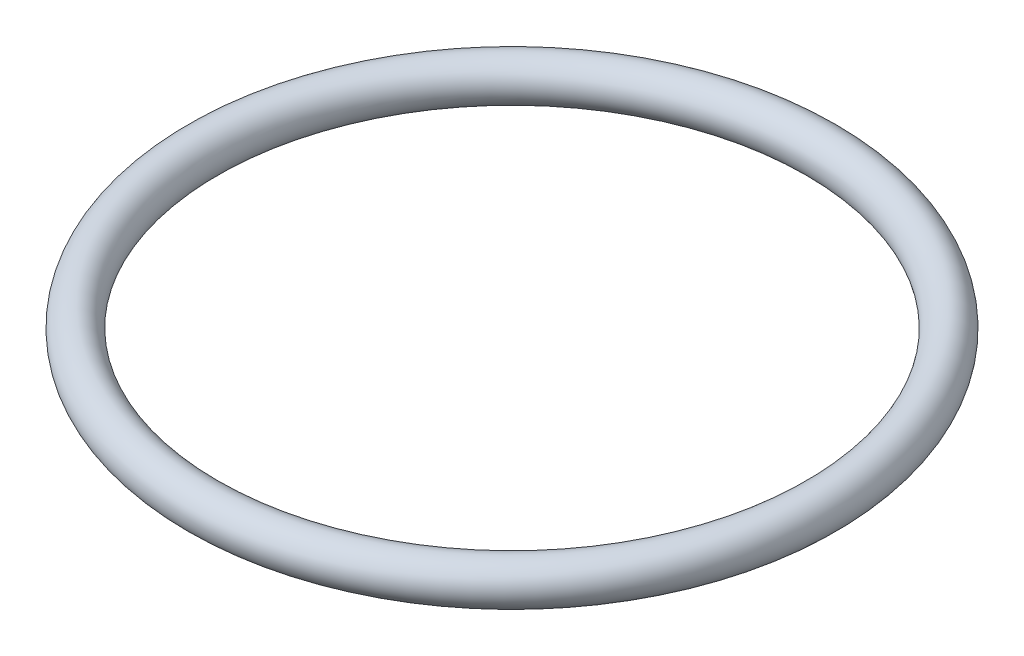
from build123d import *

# Parameters (mm, degrees)
SKETCH2_R = 0.889


with BuildPart() as part:
    # Sweep1: sweep along a path in Sketch1
    with BuildLine(Plane(origin=(0, 0, 0), x_dir=(1, 0, 0), z_dir=(0, 1, 0))) as sweep1_path:
        CenterArc((0, 0), 12.319, 0, 360)
    # Sketch2 → Sweep1 (sweep)
    with BuildSketch(Plane.XY):
        with Locations((-13.208, 0)):
            Circle(SKETCH2_R)
    sweep(path=sweep1_path.line)


solid = part.part
